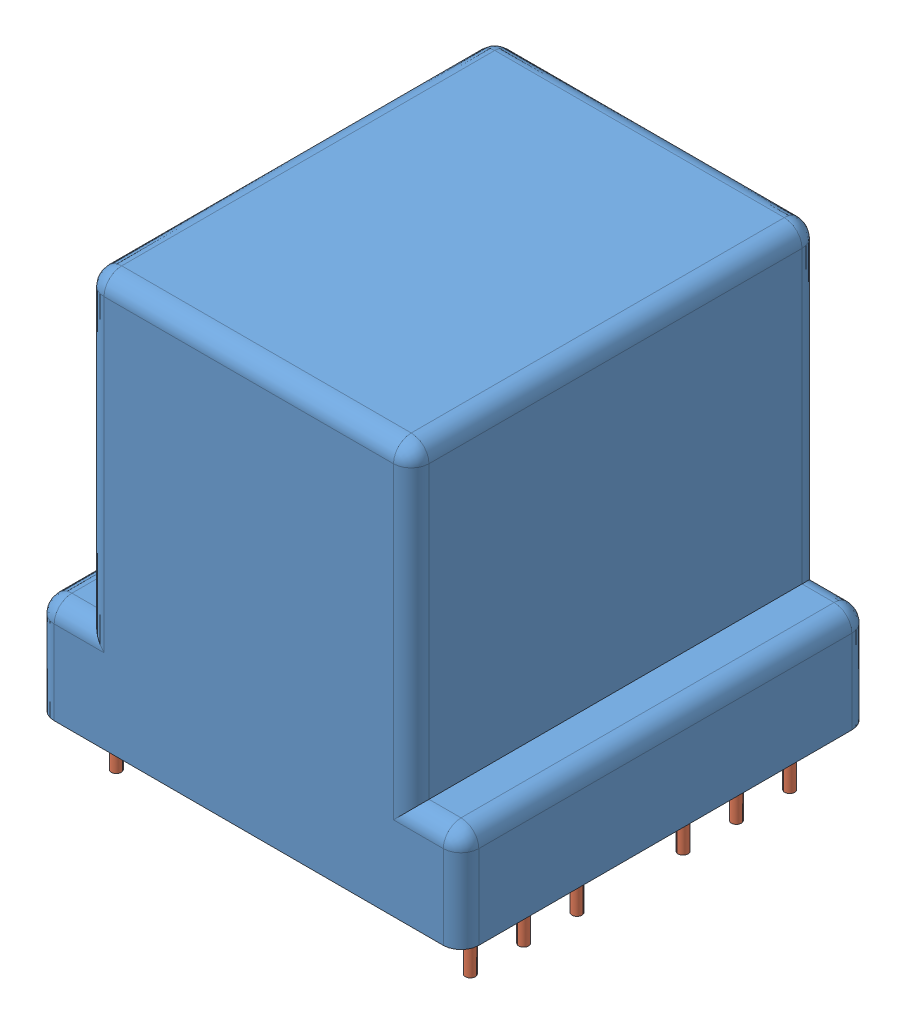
SolidWorks assembly Wurth PQ2625.sldasm, configuration Default (file format 9000). Lengths in mm.
Overall size (30.35 33.29 29.2).
6 component instances, 5 part files, 0 mates.
Components (placement in the parent):
- 070-5649_INTF-1: 070-5649_INTF.sldprt [Default] at origin size (30.35 29.3 29.2)
- 070-5649_6B-1: 070-5649_6B.sldprt [Default] at (-15.175 23.21 -28) x (-1 0 0) z (0 0 -1) size (29.38 32.29 26.8)
- 070-5649_coil-1: 070-5649_coil.sldprt [Default] at (-15.175 22.2 -14.6) x (1 0 0) z (0 1 0) size (21.5 21.5 13.6)
- 150-2239_6B-1: 150-2239_6B.sldprt [Default] at (-15.175 15.41 -14.6) x (1 0 0) z (0 1 0) size (19 27.72 12.37)
- 150-2239_6B-2: 150-2239_6B.sldprt [Default] at (-15.175 15.41 -14.6) x (-1 0 0) z (0 -1 0) size (19 27.72 12.37)
- 440-8108-2239-1: 440-8108-2239.sldprt [Default] at (-10.425 27.78 -28.4615) x (0 -1 0) z (1 0 0) size (25.06 28.04 9.5)
